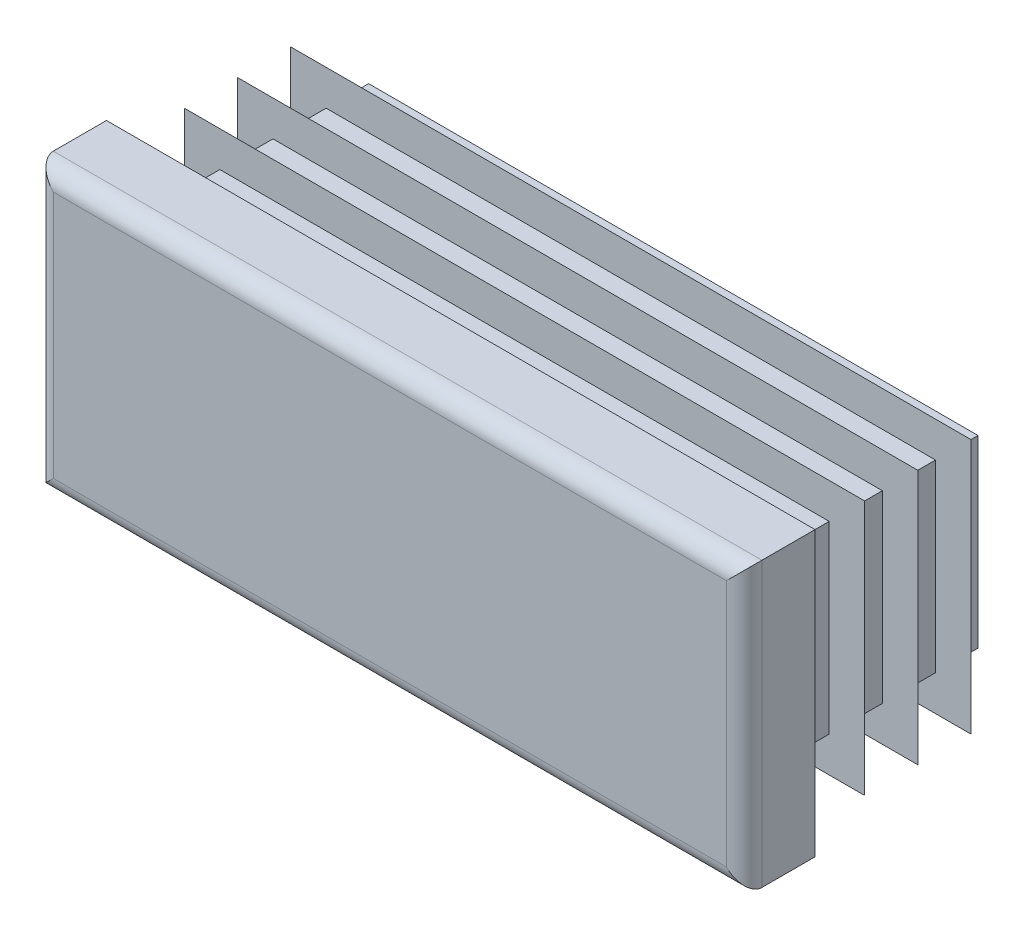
ISO-10303-21;
HEADER;
FILE_DESCRIPTION(('STEP AP214'),'2;1');
FILE_NAME('part.step','',(''),(''),'','','');
FILE_SCHEMA(('AUTOMOTIVE_DESIGN { 1 0 10303 214 1 1 1 1 }'));
ENDSEC;
DATA;
#1=APPLICATION_CONTEXT('core data for automotive mechanical design processes');
#2=APPLICATION_PROTOCOL_DEFINITION('international standard','automotive_design',2000,#1);
#3=PRODUCT_CONTEXT('',#1,'mechanical');
#4=PRODUCT('Part','Part','',(#3));
#5=PRODUCT_RELATED_PRODUCT_CATEGORY('part','',(#4));
#6=PRODUCT_DEFINITION_FORMATION('','',#4);
#7=PRODUCT_DEFINITION_CONTEXT('part definition',#1,'design');
#8=PRODUCT_DEFINITION('design','',#6,#7);
#9=PRODUCT_DEFINITION_SHAPE('','',#8);
#10=(LENGTH_UNIT() NAMED_UNIT(*) SI_UNIT(.MILLI.,.METRE.));
#11=(NAMED_UNIT(*) PLANE_ANGLE_UNIT() SI_UNIT($,.RADIAN.));
#12=(NAMED_UNIT(*) SI_UNIT($,.STERADIAN.) SOLID_ANGLE_UNIT());
#13=UNCERTAINTY_MEASURE_WITH_UNIT(LENGTH_MEASURE(1.E-05),#10,'distance_accuracy_value','');
#14=(GEOMETRIC_REPRESENTATION_CONTEXT(3) GLOBAL_UNCERTAINTY_ASSIGNED_CONTEXT((#13)) GLOBAL_UNIT_ASSIGNED_CONTEXT((#10,
#11,#12)) REPRESENTATION_CONTEXT('',''));
#15=CARTESIAN_POINT('',(0.,0.,0.));
#16=DIRECTION('',(0.,0.,1.));
#17=DIRECTION('',(1.,0.,0.));
#18=AXIS2_PLACEMENT_3D('',#15,#16,#17);
#19=CARTESIAN_POINT('',(23.75,-10.,5.));
#20=DIRECTION('',(0.,0.,-1.));
#21=DIRECTION('',(0.,1.,0.));
#22=AXIS2_PLACEMENT_3D('',#19,#20,#21);
#23=PLANE('',#22);
#24=DIRECTION('',(0.,1.,0.));
#25=VECTOR('',#24,1.);
#26=CARTESIAN_POINT('',(-23.75,-10.,5.));
#27=LINE('',#26,#25);
#28=CARTESIAN_POINT('',(-23.75,-8.75,5.));
#29=VERTEX_POINT('',#28);
#30=CARTESIAN_POINT('',(-23.75,8.75,5.));
#31=VERTEX_POINT('',#30);
#32=EDGE_CURVE('E310',#29,#31,#27,.T.);
#33=ORIENTED_EDGE('',*,*,#32,.F.);
#34=DIRECTION('',(-1.,0.,0.));
#35=VECTOR('',#34,1.);
#36=CARTESIAN_POINT('',(25.,-8.75,5.));
#37=LINE('',#36,#35);
#38=CARTESIAN_POINT('',(23.75,-8.75,5.));
#39=VERTEX_POINT('',#38);
#40=EDGE_CURVE('E482',#39,#29,#37,.T.);
#41=ORIENTED_EDGE('',*,*,#40,.F.);
#42=DIRECTION('',(0.,1.,0.));
#43=VECTOR('',#42,1.);
#44=CARTESIAN_POINT('',(23.75,-10.,5.));
#45=LINE('',#44,#43);
#46=CARTESIAN_POINT('',(23.75,8.75,5.));
#47=VERTEX_POINT('',#46);
#48=EDGE_CURVE('E305',#39,#47,#45,.T.);
#49=ORIENTED_EDGE('',*,*,#48,.T.);
#50=DIRECTION('',(-1.,0.,0.));
#51=VECTOR('',#50,1.);
#52=CARTESIAN_POINT('',(25.,8.75,5.));
#53=LINE('',#52,#51);
#54=EDGE_CURVE('E630',#47,#31,#53,.T.);
#55=ORIENTED_EDGE('',*,*,#54,.T.);
#56=EDGE_LOOP('',(#33,#41,#49,#55));
#57=FACE_BOUND('',#56,.T.);
#58=ADVANCED_FACE('F14',(#57),#23,.F.);
#59=CARTESIAN_POINT('',(-23.75,-10.,3.75));
#60=DIRECTION('',(0.,1.,0.));
#61=DIRECTION('',(-1.,0.,0.));
#62=AXIS2_PLACEMENT_3D('',#59,#60,#61);
#63=CYLINDRICAL_SURFACE('',#62,1.25);
#64=DIRECTION('',(0.,1.,0.));
#65=VECTOR('',#64,1.);
#66=CARTESIAN_POINT('',(-25.,-10.,3.75));
#67=LINE('',#66,#65);
#68=CARTESIAN_POINT('',(-25.,-10.,3.75));
#69=VERTEX_POINT('',#68);
#70=CARTESIAN_POINT('',(-25.,10.,3.75));
#71=VERTEX_POINT('',#70);
#72=EDGE_CURVE('E402',#69,#71,#67,.T.);
#73=ORIENTED_EDGE('',*,*,#72,.F.);
#74=CARTESIAN_POINT('',(-23.75,-8.75,3.75));
#75=DIRECTION('',(-0.707106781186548,0.707106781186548,0.));
#76=DIRECTION('',(0.707106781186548,0.707106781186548,0.));
#77=AXIS2_PLACEMENT_3D('',#74,#75,#76);
#78=ELLIPSE('',#77,1.76776695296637,1.25);
#79=EDGE_CURVE('E59',#69,#29,#78,.T.);
#80=ORIENTED_EDGE('',*,*,#79,.T.);
#81=ORIENTED_EDGE('',*,*,#32,.T.);
#82=CARTESIAN_POINT('',(-23.75,8.75,3.75));
#83=DIRECTION('',(0.707106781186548,0.707106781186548,0.));
#84=DIRECTION('',(-0.707106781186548,0.707106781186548,0.));
#85=AXIS2_PLACEMENT_3D('',#82,#83,#84);
#86=ELLIPSE('',#85,1.76776695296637,1.25);
#87=EDGE_CURVE('E306',#31,#71,#86,.F.);
#88=ORIENTED_EDGE('',*,*,#87,.T.);
#89=EDGE_LOOP('',(#73,#80,#81,#88));
#90=FACE_BOUND('',#89,.T.);
#91=ADVANCED_FACE('F16',(#90),#63,.T.);
#92=CARTESIAN_POINT('',(-25.,-10.,3.75));
#93=DIRECTION('',(1.,0.,0.));
#94=DIRECTION('',(0.,1.,0.));
#95=AXIS2_PLACEMENT_3D('',#92,#93,#94);
#96=PLANE('',#95);
#97=DIRECTION('',(0.,0.,-1.));
#98=VECTOR('',#97,1.);
#99=CARTESIAN_POINT('',(-25.,10.,3.75));
#100=LINE('',#99,#98);
#101=CARTESIAN_POINT('',(-25.,10.,0.));
#102=VERTEX_POINT('',#101);
#103=EDGE_CURVE('E615',#71,#102,#100,.T.);
#104=ORIENTED_EDGE('',*,*,#103,.T.);
#105=DIRECTION('',(0.,1.,0.));
#106=VECTOR('',#105,1.);
#107=CARTESIAN_POINT('',(-25.,-10.,0.));
#108=LINE('',#107,#106);
#109=CARTESIAN_POINT('',(-25.,-10.,0.));
#110=VERTEX_POINT('',#109);
#111=EDGE_CURVE('E400',#110,#102,#108,.T.);
#112=ORIENTED_EDGE('',*,*,#111,.F.);
#113=DIRECTION('',(0.,0.,-1.));
#114=VECTOR('',#113,1.);
#115=CARTESIAN_POINT('',(-25.,-10.,3.75));
#116=LINE('',#115,#114);
#117=EDGE_CURVE('E616',#69,#110,#116,.T.);
#118=ORIENTED_EDGE('',*,*,#117,.F.);
#119=ORIENTED_EDGE('',*,*,#72,.T.);
#120=EDGE_LOOP('',(#104,#112,#118,#119));
#121=FACE_BOUND('',#120,.T.);
#122=ADVANCED_FACE('F697',(#121),#96,.F.);
#123=CARTESIAN_POINT('',(-21.5,-10.,0.));
#124=DIRECTION('',(1.,0.,0.));
#125=DIRECTION('',(0.,1.,0.));
#126=AXIS2_PLACEMENT_3D('',#123,#124,#125);
#127=PLANE('',#126);
#128=DIRECTION('',(0.,1.,0.));
#129=VECTOR('',#128,1.);
#130=CARTESIAN_POINT('',(-21.5,-10.,0.));
#131=LINE('',#130,#129);
#132=CARTESIAN_POINT('',(-21.5,-6.5,0.));
#133=VERTEX_POINT('',#132);
#134=CARTESIAN_POINT('',(-21.5,6.5,0.));
#135=VERTEX_POINT('',#134);
#136=EDGE_CURVE('E397',#133,#135,#131,.T.);
#137=ORIENTED_EDGE('',*,*,#136,.T.);
#138=DIRECTION('',(0.,0.,-1.));
#139=VECTOR('',#138,1.);
#140=CARTESIAN_POINT('',(-21.5,6.5,0.));
#141=LINE('',#140,#139);
#142=CARTESIAN_POINT('',(-21.5,6.5,-0.75));
#143=VERTEX_POINT('',#142);
#144=EDGE_CURVE('E495',#135,#143,#141,.T.);
#145=ORIENTED_EDGE('',*,*,#144,.T.);
#146=DIRECTION('',(0.,1.,0.));
#147=VECTOR('',#146,1.);
#148=CARTESIAN_POINT('',(-21.5,-10.,-0.75));
#149=LINE('',#148,#147);
#150=CARTESIAN_POINT('',(-21.5,-6.5,-0.75));
#151=VERTEX_POINT('',#150);
#152=EDGE_CURVE('E394',#151,#143,#149,.T.);
#153=ORIENTED_EDGE('',*,*,#152,.F.);
#154=DIRECTION('',(0.,0.,1.));
#155=VECTOR('',#154,1.);
#156=CARTESIAN_POINT('',(-21.5,-6.5,0.));
#157=LINE('',#156,#155);
#158=EDGE_CURVE('E489',#151,#133,#157,.T.);
#159=ORIENTED_EDGE('',*,*,#158,.T.);
#160=EDGE_LOOP('',(#137,#145,#153,#159));
#161=FACE_BOUND('',#160,.T.);
#162=ADVANCED_FACE('F787',(#161),#127,.F.);
#163=CARTESIAN_POINT('',(-24.,-10.,-0.75));
#164=DIRECTION('',(0.342020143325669,0.,0.939692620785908));
#165=DIRECTION('',(-0.939692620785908,0.,0.342020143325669));
#166=AXIS2_PLACEMENT_3D('',#163,#164,#165);
#167=PLANE('',#166);
#168=DIRECTION('',(0.,1.,0.));
#169=VECTOR('',#168,1.);
#170=CARTESIAN_POINT('',(-24.,-10.,-0.75));
#171=LINE('',#170,#169);
#172=CARTESIAN_POINT('',(-24.,-9.,-0.75));
#173=VERTEX_POINT('',#172);
#174=CARTESIAN_POINT('',(-24.,9.,-0.75));
#175=VERTEX_POINT('',#174);
#176=EDGE_CURVE('E392',#173,#175,#171,.T.);
#177=ORIENTED_EDGE('',*,*,#176,.T.);
#178=DIRECTION('',(0.844349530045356,-0.438895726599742,-0.307318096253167));
#179=VECTOR('',#178,1.);
#180=CARTESIAN_POINT('',(-16.9589533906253,5.34004028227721,-3.31273138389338));
#181=LINE('',#180,#179);
#182=CARTESIAN_POINT('',(-21.5,7.70049158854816,-1.65992558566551));
#183=VERTEX_POINT('',#182);
#184=EDGE_CURVE('E519',#175,#183,#181,.T.);
#185=ORIENTED_EDGE('',*,*,#184,.T.);
#186=DIRECTION('',(0.,1.,0.));
#187=VECTOR('',#186,1.);
#188=CARTESIAN_POINT('',(-21.5,-10.,-1.65992558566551));
#189=LINE('',#188,#187);
#190=CARTESIAN_POINT('',(-21.5,-7.70049158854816,-1.65992558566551));
#191=VERTEX_POINT('',#190);
#192=EDGE_CURVE('E389',#191,#183,#189,.T.);
#193=ORIENTED_EDGE('',*,*,#192,.F.);
#194=DIRECTION('',(-0.844349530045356,-0.438895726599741,0.307318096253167));
#195=VECTOR('',#194,1.);
#196=CARTESIAN_POINT('',(-24.3705814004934,-9.19262945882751,-0.615119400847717));
#197=LINE('',#196,#195);
#198=EDGE_CURVE('E507',#191,#173,#197,.T.);
#199=ORIENTED_EDGE('',*,*,#198,.T.);
#200=EDGE_LOOP('',(#177,#185,#193,#199));
#201=FACE_BOUND('',#200,.T.);
#202=ADVANCED_FACE('F783',(#201),#167,.F.);
#203=CARTESIAN_POINT('',(-21.5,-10.,-1.65992558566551));
#204=DIRECTION('',(1.,0.,0.));
#205=DIRECTION('',(0.,1.,0.));
#206=AXIS2_PLACEMENT_3D('',#203,#204,#205);
#207=PLANE('',#206);
#208=ORIENTED_EDGE('',*,*,#192,.T.);
#209=DIRECTION('',(0.,-0.819152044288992,-0.573576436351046));
#210=VECTOR('',#209,1.);
#211=CARTESIAN_POINT('',(-21.5,-4.17671654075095,-9.97643625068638));
#212=LINE('',#211,#210);
#213=CARTESIAN_POINT('',(-21.5,6.5,-2.50051884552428));
#214=VERTEX_POINT('',#213);
#215=EDGE_CURVE('E516',#183,#214,#212,.T.);
#216=ORIENTED_EDGE('',*,*,#215,.T.);
#217=DIRECTION('',(0.,0.,-1.));
#218=VECTOR('',#217,1.);
#219=CARTESIAN_POINT('',(-21.5,6.5,-1.65992558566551));
#220=LINE('',#219,#218);
#221=CARTESIAN_POINT('',(-21.5,6.5,-4.5));
#222=VERTEX_POINT('',#221);
#223=EDGE_CURVE('E525',#214,#222,#220,.T.);
#224=ORIENTED_EDGE('',*,*,#223,.T.);
#225=DIRECTION('',(0.,1.,0.));
#226=VECTOR('',#225,1.);
#227=CARTESIAN_POINT('',(-21.5,-10.,-4.5));
#228=LINE('',#227,#226);
#229=CARTESIAN_POINT('',(-21.5,-6.5,-4.5));
#230=VERTEX_POINT('',#229);
#231=EDGE_CURVE('E386',#230,#222,#228,.T.);
#232=ORIENTED_EDGE('',*,*,#231,.F.);
#233=DIRECTION('',(0.,0.,1.));
#234=VECTOR('',#233,1.);
#235=CARTESIAN_POINT('',(-21.5,-6.5,-1.65992558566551));
#236=LINE('',#235,#234);
#237=CARTESIAN_POINT('',(-21.5,-6.5,-2.50051884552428));
#238=VERTEX_POINT('',#237);
#239=EDGE_CURVE('E522',#230,#238,#236,.T.);
#240=ORIENTED_EDGE('',*,*,#239,.T.);
#241=DIRECTION('',(0.,-0.819152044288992,0.573576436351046));
#242=VECTOR('',#241,1.);
#243=CARTESIAN_POINT('',(-21.5,-9.24348489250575,-0.579510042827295));
#244=LINE('',#243,#242);
#245=EDGE_CURVE('E504',#238,#191,#244,.T.);
#246=ORIENTED_EDGE('',*,*,#245,.T.);
#247=EDGE_LOOP('',(#208,#216,#224,#232,#240,#246));
#248=FACE_BOUND('',#247,.T.);
#249=ADVANCED_FACE('F779',(#248),#207,.F.);
#250=CARTESIAN_POINT('',(-24.,-10.,-4.5));
#251=DIRECTION('',(0.342020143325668,0.,0.939692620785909));
#252=DIRECTION('',(-0.939692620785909,0.,0.342020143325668));
#253=AXIS2_PLACEMENT_3D('',#250,#251,#252);
#254=PLANE('',#253);
#255=DIRECTION('',(0.,1.,0.));
#256=VECTOR('',#255,1.);
#257=CARTESIAN_POINT('',(-24.,-10.,-4.5));
#258=LINE('',#257,#256);
#259=CARTESIAN_POINT('',(-24.,-9.,-4.5));
#260=VERTEX_POINT('',#259);
#261=CARTESIAN_POINT('',(-24.,9.,-4.5));
#262=VERTEX_POINT('',#261);
#263=EDGE_CURVE('E384',#260,#262,#258,.T.);
#264=ORIENTED_EDGE('',*,*,#263,.T.);
#265=DIRECTION('',(0.844349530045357,-0.43889572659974,-0.307318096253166));
#266=VECTOR('',#265,1.);
#267=CARTESIAN_POINT('',(-16.9589533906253,5.34004028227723,-7.06273138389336));
#268=LINE('',#267,#266);
#269=CARTESIAN_POINT('',(-21.5,7.70049158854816,-5.4099255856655));
#270=VERTEX_POINT('',#269);
#271=EDGE_CURVE('E549',#262,#270,#268,.T.);
#272=ORIENTED_EDGE('',*,*,#271,.T.);
#273=DIRECTION('',(0.,1.,0.));
#274=VECTOR('',#273,1.);
#275=CARTESIAN_POINT('',(-21.5,-10.,-5.4099255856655));
#276=LINE('',#275,#274);
#277=CARTESIAN_POINT('',(-21.5,-7.70049158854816,-5.4099255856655));
#278=VERTEX_POINT('',#277);
#279=EDGE_CURVE('E381',#278,#270,#276,.T.);
#280=ORIENTED_EDGE('',*,*,#279,.F.);
#281=DIRECTION('',(-0.844349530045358,-0.43889572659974,0.307318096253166));
#282=VECTOR('',#281,1.);
#283=CARTESIAN_POINT('',(-24.3705814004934,-9.19262945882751,-4.36511940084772));
#284=LINE('',#283,#282);
#285=EDGE_CURVE('E537',#278,#260,#284,.T.);
#286=ORIENTED_EDGE('',*,*,#285,.T.);
#287=EDGE_LOOP('',(#264,#272,#280,#286));
#288=FACE_BOUND('',#287,.T.);
#289=ADVANCED_FACE('F775',(#288),#254,.F.);
#290=CARTESIAN_POINT('',(-21.5,-10.,-5.4099255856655));
#291=DIRECTION('',(1.,0.,0.));
#292=DIRECTION('',(0.,1.,0.));
#293=AXIS2_PLACEMENT_3D('',#290,#291,#292);
#294=PLANE('',#293);
#295=ORIENTED_EDGE('',*,*,#279,.T.);
#296=DIRECTION('',(0.,-0.819152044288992,-0.573576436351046));
#297=VECTOR('',#296,1.);
#298=CARTESIAN_POINT('',(-21.5,-4.17671654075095,-13.7264362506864));
#299=LINE('',#298,#297);
#300=CARTESIAN_POINT('',(-21.5,6.5,-6.25051884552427));
#301=VERTEX_POINT('',#300);
#302=EDGE_CURVE('E546',#270,#301,#299,.T.);
#303=ORIENTED_EDGE('',*,*,#302,.T.);
#304=DIRECTION('',(0.,0.,-1.));
#305=VECTOR('',#304,1.);
#306=CARTESIAN_POINT('',(-21.5,6.5,-5.4099255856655));
#307=LINE('',#306,#305);
#308=CARTESIAN_POINT('',(-21.5,6.5,-8.25));
#309=VERTEX_POINT('',#308);
#310=EDGE_CURVE('E555',#301,#309,#307,.T.);
#311=ORIENTED_EDGE('',*,*,#310,.T.);
#312=DIRECTION('',(0.,1.,0.));
#313=VECTOR('',#312,1.);
#314=CARTESIAN_POINT('',(-21.5,-10.,-8.25));
#315=LINE('',#314,#313);
#316=CARTESIAN_POINT('',(-21.5,-6.5,-8.25));
#317=VERTEX_POINT('',#316);
#318=EDGE_CURVE('E378',#317,#309,#315,.T.);
#319=ORIENTED_EDGE('',*,*,#318,.F.);
#320=DIRECTION('',(0.,0.,1.));
#321=VECTOR('',#320,1.);
#322=CARTESIAN_POINT('',(-21.5,-6.5,-5.4099255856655));
#323=LINE('',#322,#321);
#324=CARTESIAN_POINT('',(-21.5,-6.5,-6.25051884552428));
#325=VERTEX_POINT('',#324);
#326=EDGE_CURVE('E552',#317,#325,#323,.T.);
#327=ORIENTED_EDGE('',*,*,#326,.T.);
#328=DIRECTION('',(0.,-0.819152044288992,0.573576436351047));
#329=VECTOR('',#328,1.);
#330=CARTESIAN_POINT('',(-21.5,-9.24348489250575,-4.32951004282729));
#331=LINE('',#330,#329);
#332=EDGE_CURVE('E534',#325,#278,#331,.T.);
#333=ORIENTED_EDGE('',*,*,#332,.T.);
#334=EDGE_LOOP('',(#295,#303,#311,#319,#327,#333));
#335=FACE_BOUND('',#334,.T.);
#336=ADVANCED_FACE('F771',(#335),#294,.F.);
#337=CARTESIAN_POINT('',(-24.,-10.,-8.25));
#338=DIRECTION('',(0.342020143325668,0.,0.939692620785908));
#339=DIRECTION('',(-0.939692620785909,0.,0.342020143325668));
#340=AXIS2_PLACEMENT_3D('',#337,#338,#339);
#341=PLANE('',#340);
#342=DIRECTION('',(0.,1.,0.));
#343=VECTOR('',#342,1.);
#344=CARTESIAN_POINT('',(-24.,-10.,-8.25));
#345=LINE('',#344,#343);
#346=CARTESIAN_POINT('',(-24.,-9.,-8.25));
#347=VERTEX_POINT('',#346);
#348=CARTESIAN_POINT('',(-24.,9.,-8.25));
#349=VERTEX_POINT('',#348);
#350=EDGE_CURVE('E376',#347,#349,#345,.T.);
#351=ORIENTED_EDGE('',*,*,#350,.T.);
#352=DIRECTION('',(0.844349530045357,-0.438895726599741,-0.307318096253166));
#353=VECTOR('',#352,1.);
#354=CARTESIAN_POINT('',(-16.9589533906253,5.34004028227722,-10.8127313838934));
#355=LINE('',#354,#353);
#356=CARTESIAN_POINT('',(-21.5,7.70049158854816,-9.1599255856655));
#357=VERTEX_POINT('',#356);
#358=EDGE_CURVE('E579',#349,#357,#355,.T.);
#359=ORIENTED_EDGE('',*,*,#358,.T.);
#360=DIRECTION('',(0.,1.,0.));
#361=VECTOR('',#360,1.);
#362=CARTESIAN_POINT('',(-21.5,-10.,-9.1599255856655));
#363=LINE('',#362,#361);
#364=CARTESIAN_POINT('',(-21.5,-7.70049158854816,-9.1599255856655));
#365=VERTEX_POINT('',#364);
#366=EDGE_CURVE('E373',#365,#357,#363,.T.);
#367=ORIENTED_EDGE('',*,*,#366,.F.);
#368=DIRECTION('',(-0.844349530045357,-0.43889572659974,0.307318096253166));
#369=VECTOR('',#368,1.);
#370=CARTESIAN_POINT('',(-24.3705814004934,-9.19262945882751,-8.11511940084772));
#371=LINE('',#370,#369);
#372=EDGE_CURVE('E567',#365,#347,#371,.T.);
#373=ORIENTED_EDGE('',*,*,#372,.T.);
#374=EDGE_LOOP('',(#351,#359,#367,#373));
#375=FACE_BOUND('',#374,.T.);
#376=ADVANCED_FACE('F767',(#375),#341,.F.);
#377=CARTESIAN_POINT('',(-21.5,-10.,-9.1599255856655));
#378=DIRECTION('',(1.,0.,0.));
#379=DIRECTION('',(0.,1.,0.));
#380=AXIS2_PLACEMENT_3D('',#377,#378,#379);
#381=PLANE('',#380);
#382=ORIENTED_EDGE('',*,*,#366,.T.);
#383=DIRECTION('',(0.,-0.819152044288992,-0.573576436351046));
#384=VECTOR('',#383,1.);
#385=CARTESIAN_POINT('',(-21.5,-4.17671654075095,-17.4764362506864));
#386=LINE('',#385,#384);
#387=CARTESIAN_POINT('',(-21.5,6.5,-10.0005188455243));
#388=VERTEX_POINT('',#387);
#389=EDGE_CURVE('E576',#357,#388,#386,.T.);
#390=ORIENTED_EDGE('',*,*,#389,.T.);
#391=DIRECTION('',(0.,0.,-1.));
#392=VECTOR('',#391,1.);
#393=CARTESIAN_POINT('',(-21.5,6.5,-9.1599255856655));
#394=LINE('',#393,#392);
#395=CARTESIAN_POINT('',(-21.5,6.5,-12.));
#396=VERTEX_POINT('',#395);
#397=EDGE_CURVE('E585',#388,#396,#394,.T.);
#398=ORIENTED_EDGE('',*,*,#397,.T.);
#399=DIRECTION('',(0.,1.,0.));
#400=VECTOR('',#399,1.);
#401=CARTESIAN_POINT('',(-21.5,-10.,-12.));
#402=LINE('',#401,#400);
#403=CARTESIAN_POINT('',(-21.5,-6.5,-12.));
#404=VERTEX_POINT('',#403);
#405=EDGE_CURVE('E370',#404,#396,#402,.T.);
#406=ORIENTED_EDGE('',*,*,#405,.F.);
#407=DIRECTION('',(0.,0.,1.));
#408=VECTOR('',#407,1.);
#409=CARTESIAN_POINT('',(-21.5,-6.5,-9.1599255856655));
#410=LINE('',#409,#408);
#411=CARTESIAN_POINT('',(-21.5,-6.5,-10.0005188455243));
#412=VERTEX_POINT('',#411);
#413=EDGE_CURVE('E582',#404,#412,#410,.T.);
#414=ORIENTED_EDGE('',*,*,#413,.T.);
#415=DIRECTION('',(0.,-0.819152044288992,0.573576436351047));
#416=VECTOR('',#415,1.);
#417=CARTESIAN_POINT('',(-21.5,-9.24348489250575,-8.0795100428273));
#418=LINE('',#417,#416);
#419=EDGE_CURVE('E564',#412,#365,#418,.T.);
#420=ORIENTED_EDGE('',*,*,#419,.T.);
#421=EDGE_LOOP('',(#382,#390,#398,#406,#414,#420));
#422=FACE_BOUND('',#421,.T.);
#423=ADVANCED_FACE('F764',(#422),#381,.F.);
#424=CARTESIAN_POINT('',(-24.,-10.,-12.));
#425=DIRECTION('',(0.342020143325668,0.,0.939692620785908));
#426=DIRECTION('',(-0.939692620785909,0.,0.342020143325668));
#427=AXIS2_PLACEMENT_3D('',#424,#425,#426);
#428=PLANE('',#427);
#429=DIRECTION('',(0.,1.,0.));
#430=VECTOR('',#429,1.);
#431=CARTESIAN_POINT('',(-24.,-10.,-12.));
#432=LINE('',#431,#430);
#433=CARTESIAN_POINT('',(-24.,-9.,-12.));
#434=VERTEX_POINT('',#433);
#435=CARTESIAN_POINT('',(-24.,9.,-12.));
#436=VERTEX_POINT('',#435);
#437=EDGE_CURVE('E368',#434,#436,#432,.T.);
#438=ORIENTED_EDGE('',*,*,#437,.T.);
#439=DIRECTION('',(0.844349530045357,-0.438895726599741,-0.307318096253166));
#440=VECTOR('',#439,1.);
#441=CARTESIAN_POINT('',(-16.9589533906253,5.34004028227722,-14.5627313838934));
#442=LINE('',#441,#440);
#443=CARTESIAN_POINT('',(-21.5,7.70049158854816,-12.9099255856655));
#444=VERTEX_POINT('',#443);
#445=EDGE_CURVE('E607',#436,#444,#442,.T.);
#446=ORIENTED_EDGE('',*,*,#445,.T.);
#447=DIRECTION('',(0.,1.,0.));
#448=VECTOR('',#447,1.);
#449=CARTESIAN_POINT('',(-21.5,-10.,-12.9099255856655));
#450=LINE('',#449,#448);
#451=CARTESIAN_POINT('',(-21.5,-7.70049158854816,-12.9099255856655));
#452=VERTEX_POINT('',#451);
#453=EDGE_CURVE('E365',#452,#444,#450,.T.);
#454=ORIENTED_EDGE('',*,*,#453,.F.);
#455=DIRECTION('',(-0.844349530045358,-0.43889572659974,0.307318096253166));
#456=VECTOR('',#455,1.);
#457=CARTESIAN_POINT('',(-24.3705814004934,-9.19262945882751,-11.8651194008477));
#458=LINE('',#457,#456);
#459=EDGE_CURVE('E595',#452,#434,#458,.T.);
#460=ORIENTED_EDGE('',*,*,#459,.T.);
#461=EDGE_LOOP('',(#438,#446,#454,#460));
#462=FACE_BOUND('',#461,.T.);
#463=ADVANCED_FACE('F675',(#462),#428,.F.);
#464=CARTESIAN_POINT('',(-21.5,-10.,-12.9099255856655));
#465=DIRECTION('',(1.,0.,0.));
#466=DIRECTION('',(0.,1.,0.));
#467=AXIS2_PLACEMENT_3D('',#464,#465,#466);
#468=PLANE('',#467);
#469=ORIENTED_EDGE('',*,*,#453,.T.);
#470=DIRECTION('',(0.,-0.819152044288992,-0.573576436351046));
#471=VECTOR('',#470,1.);
#472=CARTESIAN_POINT('',(-21.5,-4.17671654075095,-21.2264362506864));
#473=LINE('',#472,#471);
#474=CARTESIAN_POINT('',(-21.5,6.5,-13.7505188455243));
#475=VERTEX_POINT('',#474);
#476=EDGE_CURVE('E604',#444,#475,#473,.T.);
#477=ORIENTED_EDGE('',*,*,#476,.T.);
#478=DIRECTION('',(0.,0.,-1.));
#479=VECTOR('',#478,1.);
#480=CARTESIAN_POINT('',(-21.5,6.5,-12.9099255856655));
#481=LINE('',#480,#479);
#482=CARTESIAN_POINT('',(-21.5,6.5,-15.));
#483=VERTEX_POINT('',#482);
#484=EDGE_CURVE('E613',#475,#483,#481,.T.);
#485=ORIENTED_EDGE('',*,*,#484,.T.);
#486=DIRECTION('',(0.,1.,0.));
#487=VECTOR('',#486,1.);
#488=CARTESIAN_POINT('',(-21.5,-10.,-15.));
#489=LINE('',#488,#487);
#490=CARTESIAN_POINT('',(-21.5,-6.5,-15.));
#491=VERTEX_POINT('',#490);
#492=EDGE_CURVE('E362',#491,#483,#489,.T.);
#493=ORIENTED_EDGE('',*,*,#492,.F.);
#494=DIRECTION('',(0.,0.,1.));
#495=VECTOR('',#494,1.);
#496=CARTESIAN_POINT('',(-21.5,-6.5,-12.9099255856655));
#497=LINE('',#496,#495);
#498=CARTESIAN_POINT('',(-21.5,-6.5,-13.7505188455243));
#499=VERTEX_POINT('',#498);
#500=EDGE_CURVE('E610',#491,#499,#497,.T.);
#501=ORIENTED_EDGE('',*,*,#500,.T.);
#502=DIRECTION('',(0.,-0.819152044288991,0.573576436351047));
#503=VECTOR('',#502,1.);
#504=CARTESIAN_POINT('',(-21.5,-9.24348489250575,-11.8295100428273));
#505=LINE('',#504,#503);
#506=EDGE_CURVE('E592',#499,#452,#505,.T.);
#507=ORIENTED_EDGE('',*,*,#506,.T.);
#508=EDGE_LOOP('',(#469,#477,#485,#493,#501,#507));
#509=FACE_BOUND('',#508,.T.);
#510=ADVANCED_FACE('F677',(#509),#468,.F.);
#511=CARTESIAN_POINT('',(-21.5,-10.,-15.));
#512=DIRECTION('',(0.,0.,1.));
#513=DIRECTION('',(0.,-1.,0.));
#514=AXIS2_PLACEMENT_3D('',#511,#512,#513);
#515=PLANE('',#514);
#516=ORIENTED_EDGE('',*,*,#492,.T.);
#517=DIRECTION('',(-1.,0.,0.));
#518=VECTOR('',#517,1.);
#519=CARTESIAN_POINT('',(25.,6.5,-15.));
#520=LINE('',#519,#518);
#521=CARTESIAN_POINT('',(21.5,6.5,-15.));
#522=VERTEX_POINT('',#521);
#523=EDGE_CURVE('E438',#522,#483,#520,.T.);
#524=ORIENTED_EDGE('',*,*,#523,.F.);
#525=DIRECTION('',(0.,1.,0.));
#526=VECTOR('',#525,1.);
#527=CARTESIAN_POINT('',(21.5,-10.,-15.));
#528=LINE('',#527,#526);
#529=CARTESIAN_POINT('',(21.5,-6.5,-15.));
#530=VERTEX_POINT('',#529);
#531=EDGE_CURVE('E359',#530,#522,#528,.T.);
#532=ORIENTED_EDGE('',*,*,#531,.F.);
#533=DIRECTION('',(-1.,0.,0.));
#534=VECTOR('',#533,1.);
#535=CARTESIAN_POINT('',(25.,-6.5,-15.));
#536=LINE('',#535,#534);
#537=EDGE_CURVE('E436',#530,#491,#536,.T.);
#538=ORIENTED_EDGE('',*,*,#537,.T.);
#539=EDGE_LOOP('',(#516,#524,#532,#538));
#540=FACE_BOUND('',#539,.T.);
#541=ADVANCED_FACE('F435',(#540),#515,.F.);
#542=CARTESIAN_POINT('',(21.5,-10.,-15.));
#543=DIRECTION('',(-1.,0.,0.));
#544=DIRECTION('',(0.,-1.,0.));
#545=AXIS2_PLACEMENT_3D('',#542,#543,#544);
#546=PLANE('',#545);
#547=DIRECTION('',(0.,0.,1.));
#548=VECTOR('',#547,1.);
#549=CARTESIAN_POINT('',(21.5,6.5,-15.));
#550=LINE('',#549,#548);
#551=CARTESIAN_POINT('',(21.5,6.5,-13.7505188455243));
#552=VERTEX_POINT('',#551);
#553=EDGE_CURVE('E9',#522,#552,#550,.T.);
#554=ORIENTED_EDGE('',*,*,#553,.T.);
#555=DIRECTION('',(0.,0.819152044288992,0.573576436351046));
#556=VECTOR('',#555,1.);
#557=CARTESIAN_POINT('',(21.5,-5.15873029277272,-21.9140496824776));
#558=LINE('',#557,#556);
#559=CARTESIAN_POINT('',(21.5,7.70049158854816,-12.9099255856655));
#560=VERTEX_POINT('',#559);
#561=EDGE_CURVE('E601',#552,#560,#558,.T.);
#562=ORIENTED_EDGE('',*,*,#561,.T.);
#563=DIRECTION('',(0.,1.,0.));
#564=VECTOR('',#563,1.);
#565=CARTESIAN_POINT('',(21.5,-10.,-12.9099255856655));
#566=LINE('',#565,#564);
#567=CARTESIAN_POINT('',(21.5,-7.70049158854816,-12.9099255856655));
#568=VERTEX_POINT('',#567);
#569=EDGE_CURVE('E356',#568,#560,#566,.T.);
#570=ORIENTED_EDGE('',*,*,#569,.F.);
#571=DIRECTION('',(0.,0.819152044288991,-0.573576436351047));
#572=VECTOR('',#571,1.);
#573=CARTESIAN_POINT('',(21.5,-8.26147114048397,-12.5171234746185));
#574=LINE('',#573,#572);
#575=CARTESIAN_POINT('',(21.5,-6.5,-13.7505188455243));
#576=VERTEX_POINT('',#575);
#577=EDGE_CURVE('E428',#568,#576,#574,.T.);
#578=ORIENTED_EDGE('',*,*,#577,.T.);
#579=DIRECTION('',(0.,0.,-1.));
#580=VECTOR('',#579,1.);
#581=CARTESIAN_POINT('',(21.5,-6.5,-15.));
#582=LINE('',#581,#580);
#583=EDGE_CURVE('E23',#576,#530,#582,.T.);
#584=ORIENTED_EDGE('',*,*,#583,.T.);
#585=ORIENTED_EDGE('',*,*,#531,.T.);
#586=EDGE_LOOP('',(#554,#562,#570,#578,#584,#585));
#587=FACE_BOUND('',#586,.T.);
#588=ADVANCED_FACE('F426',(#587),#546,.F.);
#589=CARTESIAN_POINT('',(21.5,-10.,-12.9099255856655));
#590=DIRECTION('',(-0.342020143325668,0.,0.939692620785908));
#591=DIRECTION('',(-0.939692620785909,0.,-0.342020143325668));
#592=AXIS2_PLACEMENT_3D('',#589,#590,#591);
#593=PLANE('',#592);
#594=ORIENTED_EDGE('',*,*,#569,.T.);
#595=DIRECTION('',(0.844349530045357,0.438895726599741,0.307318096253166));
#596=VECTOR('',#595,1.);
#597=CARTESIAN_POINT('',(14.9405270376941,4.29085547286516,-15.2973784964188));
#598=LINE('',#597,#596);
#599=CARTESIAN_POINT('',(24.,9.,-12.));
#600=VERTEX_POINT('',#599);
#601=EDGE_CURVE('E598',#560,#600,#598,.T.);
#602=ORIENTED_EDGE('',*,*,#601,.T.);
#603=DIRECTION('',(0.,1.,0.));
#604=VECTOR('',#603,1.);
#605=CARTESIAN_POINT('',(24.,-10.,-12.));
#606=LINE('',#605,#604);
#607=CARTESIAN_POINT('',(24.,-9.,-12.));
#608=VERTEX_POINT('',#607);
#609=EDGE_CURVE('E353',#608,#600,#606,.T.);
#610=ORIENTED_EDGE('',*,*,#609,.F.);
#611=DIRECTION('',(-0.844349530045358,0.43889572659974,-0.307318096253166));
#612=VECTOR('',#611,1.);
#613=CARTESIAN_POINT('',(22.3521550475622,-8.14344464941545,-12.5997665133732));
#614=LINE('',#613,#612);
#615=EDGE_CURVE('E588',#608,#568,#614,.T.);
#616=ORIENTED_EDGE('',*,*,#615,.T.);
#617=EDGE_LOOP('',(#594,#602,#610,#616));
#618=FACE_BOUND('',#617,.T.);
#619=ADVANCED_FACE('F752',(#618),#593,.F.);
#620=CARTESIAN_POINT('',(24.,-10.,-12.));
#621=DIRECTION('',(0.,0.,-1.));
#622=DIRECTION('',(0.,1.,0.));
#623=AXIS2_PLACEMENT_3D('',#620,#621,#622);
#624=PLANE('',#623);
#625=ORIENTED_EDGE('',*,*,#609,.T.);
#626=DIRECTION('',(-1.,0.,0.));
#627=VECTOR('',#626,1.);
#628=CARTESIAN_POINT('',(25.,9.,-12.));
#629=LINE('',#628,#627);
#630=EDGE_CURVE('E444',#600,#436,#629,.T.);
#631=ORIENTED_EDGE('',*,*,#630,.T.);
#632=ORIENTED_EDGE('',*,*,#437,.F.);
#633=DIRECTION('',(-1.,0.,0.));
#634=VECTOR('',#633,1.);
#635=CARTESIAN_POINT('',(25.,-9.,-12.));
#636=LINE('',#635,#634);
#637=EDGE_CURVE('E451',#608,#434,#636,.T.);
#638=ORIENTED_EDGE('',*,*,#637,.F.);
#639=EDGE_LOOP('',(#625,#631,#632,#638));
#640=FACE_BOUND('',#639,.T.);
#641=ORIENTED_EDGE('',*,*,#405,.T.);
#642=DIRECTION('',(-1.,0.,0.));
#643=VECTOR('',#642,1.);
#644=CARTESIAN_POINT('',(25.,6.5,-12.));
#645=LINE('',#644,#643);
#646=CARTESIAN_POINT('',(21.5,6.5,-12.));
#647=VERTEX_POINT('',#646);
#648=EDGE_CURVE('E663',#647,#396,#645,.T.);
#649=ORIENTED_EDGE('',*,*,#648,.F.);
#650=DIRECTION('',(0.,1.,0.));
#651=VECTOR('',#650,1.);
#652=CARTESIAN_POINT('',(21.5,-10.,-12.));
#653=LINE('',#652,#651);
#654=CARTESIAN_POINT('',(21.5,-6.5,-12.));
#655=VERTEX_POINT('',#654);
#656=EDGE_CURVE('E350',#655,#647,#653,.T.);
#657=ORIENTED_EDGE('',*,*,#656,.F.);
#658=DIRECTION('',(-1.,0.,0.));
#659=VECTOR('',#658,1.);
#660=CARTESIAN_POINT('',(25.,-6.5,-12.));
#661=LINE('',#660,#659);
#662=EDGE_CURVE('E453',#655,#404,#661,.T.);
#663=ORIENTED_EDGE('',*,*,#662,.T.);
#664=EDGE_LOOP('',(#641,#649,#657,#663));
#665=FACE_BOUND('',#664,.T.);
#666=ADVANCED_FACE('F667',(#640,#665),#624,.F.);
#667=CARTESIAN_POINT('',(21.5,-10.,-12.));
#668=DIRECTION('',(-1.,0.,0.));
#669=DIRECTION('',(0.,-1.,0.));
#670=AXIS2_PLACEMENT_3D('',#667,#668,#669);
#671=PLANE('',#670);
#672=DIRECTION('',(0.,0.,1.));
#673=VECTOR('',#672,1.);
#674=CARTESIAN_POINT('',(21.5,6.5,-12.));
#675=LINE('',#674,#673);
#676=CARTESIAN_POINT('',(21.5,6.5,-10.0005188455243));
#677=VERTEX_POINT('',#676);
#678=EDGE_CURVE('E420',#647,#677,#675,.T.);
#679=ORIENTED_EDGE('',*,*,#678,.T.);
#680=DIRECTION('',(0.,0.819152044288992,0.573576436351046));
#681=VECTOR('',#680,1.);
#682=CARTESIAN_POINT('',(21.5,-5.51111502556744,-18.4107921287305));
#683=LINE('',#682,#681);
#684=CARTESIAN_POINT('',(21.5,7.70049158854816,-9.1599255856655));
#685=VERTEX_POINT('',#684);
#686=EDGE_CURVE('E573',#677,#685,#683,.T.);
#687=ORIENTED_EDGE('',*,*,#686,.T.);
#688=DIRECTION('',(0.,1.,0.));
#689=VECTOR('',#688,1.);
#690=CARTESIAN_POINT('',(21.5,-10.,-9.1599255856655));
#691=LINE('',#690,#689);
#692=CARTESIAN_POINT('',(21.5,-7.70049158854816,-9.1599255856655));
#693=VERTEX_POINT('',#692);
#694=EDGE_CURVE('E347',#693,#685,#691,.T.);
#695=ORIENTED_EDGE('',*,*,#694,.F.);
#696=DIRECTION('',(0.,0.819152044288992,-0.573576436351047));
#697=VECTOR('',#696,1.);
#698=CARTESIAN_POINT('',(21.5,-7.90908640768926,-9.01386592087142));
#699=LINE('',#698,#697);
#700=CARTESIAN_POINT('',(21.5,-6.5,-10.0005188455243));
#701=VERTEX_POINT('',#700);
#702=EDGE_CURVE('E561',#693,#701,#699,.T.);
#703=ORIENTED_EDGE('',*,*,#702,.T.);
#704=DIRECTION('',(0.,0.,-1.));
#705=VECTOR('',#704,1.);
#706=CARTESIAN_POINT('',(21.5,-6.5,-12.));
#707=LINE('',#706,#705);
#708=EDGE_CURVE('E417',#701,#655,#707,.T.);
#709=ORIENTED_EDGE('',*,*,#708,.T.);
#710=ORIENTED_EDGE('',*,*,#656,.T.);
#711=EDGE_LOOP('',(#679,#687,#695,#703,#709,#710));
#712=FACE_BOUND('',#711,.T.);
#713=ADVANCED_FACE('F745',(#712),#671,.F.);
#714=CARTESIAN_POINT('',(21.5,-10.,-9.1599255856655));
#715=DIRECTION('',(-0.342020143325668,0.,0.939692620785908));
#716=DIRECTION('',(-0.939692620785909,0.,-0.342020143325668));
#717=AXIS2_PLACEMENT_3D('',#714,#715,#716);
#718=PLANE('',#717);
#719=ORIENTED_EDGE('',*,*,#694,.T.);
#720=DIRECTION('',(0.844349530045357,0.438895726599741,0.307318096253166));
#721=VECTOR('',#720,1.);
#722=CARTESIAN_POINT('',(14.9405270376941,4.29085547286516,-11.5473784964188));
#723=LINE('',#722,#721);
#724=CARTESIAN_POINT('',(24.,9.,-8.25));
#725=VERTEX_POINT('',#724);
#726=EDGE_CURVE('E570',#685,#725,#723,.T.);
#727=ORIENTED_EDGE('',*,*,#726,.T.);
#728=DIRECTION('',(0.,1.,0.));
#729=VECTOR('',#728,1.);
#730=CARTESIAN_POINT('',(24.,-10.,-8.25));
#731=LINE('',#730,#729);
#732=CARTESIAN_POINT('',(24.,-9.,-8.25));
#733=VERTEX_POINT('',#732);
#734=EDGE_CURVE('E344',#733,#725,#731,.T.);
#735=ORIENTED_EDGE('',*,*,#734,.F.);
#736=DIRECTION('',(-0.844349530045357,0.43889572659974,-0.307318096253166));
#737=VECTOR('',#736,1.);
#738=CARTESIAN_POINT('',(22.3521550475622,-8.14344464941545,-8.84976651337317));
#739=LINE('',#738,#737);
#740=EDGE_CURVE('E558',#733,#693,#739,.T.);
#741=ORIENTED_EDGE('',*,*,#740,.T.);
#742=EDGE_LOOP('',(#719,#727,#735,#741));
#743=FACE_BOUND('',#742,.T.);
#744=ADVANCED_FACE('F741',(#743),#718,.F.);
#745=CARTESIAN_POINT('',(24.,-10.,-8.25));
#746=DIRECTION('',(0.,0.,-1.));
#747=DIRECTION('',(0.,1.,0.));
#748=AXIS2_PLACEMENT_3D('',#745,#746,#747);
#749=PLANE('',#748);
#750=ORIENTED_EDGE('',*,*,#734,.T.);
#751=DIRECTION('',(-1.,0.,0.));
#752=VECTOR('',#751,1.);
#753=CARTESIAN_POINT('',(25.,9.,-8.25));
#754=LINE('',#753,#752);
#755=EDGE_CURVE('E657',#725,#349,#754,.T.);
#756=ORIENTED_EDGE('',*,*,#755,.T.);
#757=ORIENTED_EDGE('',*,*,#350,.F.);
#758=DIRECTION('',(-1.,0.,0.));
#759=VECTOR('',#758,1.);
#760=CARTESIAN_POINT('',(25.,-9.,-8.25));
#761=LINE('',#760,#759);
#762=EDGE_CURVE('E459',#733,#347,#761,.T.);
#763=ORIENTED_EDGE('',*,*,#762,.F.);
#764=EDGE_LOOP('',(#750,#756,#757,#763));
#765=FACE_BOUND('',#764,.T.);
#766=ORIENTED_EDGE('',*,*,#318,.T.);
#767=DIRECTION('',(-1.,0.,0.));
#768=VECTOR('',#767,1.);
#769=CARTESIAN_POINT('',(25.,6.5,-8.25));
#770=LINE('',#769,#768);
#771=CARTESIAN_POINT('',(21.5,6.5,-8.25));
#772=VERTEX_POINT('',#771);
#773=EDGE_CURVE('E655',#772,#309,#770,.T.);
#774=ORIENTED_EDGE('',*,*,#773,.F.);
#775=DIRECTION('',(0.,1.,0.));
#776=VECTOR('',#775,1.);
#777=CARTESIAN_POINT('',(21.5,-10.,-8.25));
#778=LINE('',#777,#776);
#779=CARTESIAN_POINT('',(21.5,-6.5,-8.25));
#780=VERTEX_POINT('',#779);
#781=EDGE_CURVE('E341',#780,#772,#778,.T.);
#782=ORIENTED_EDGE('',*,*,#781,.F.);
#783=DIRECTION('',(-1.,0.,0.));
#784=VECTOR('',#783,1.);
#785=CARTESIAN_POINT('',(25.,-6.5,-8.25));
#786=LINE('',#785,#784);
#787=EDGE_CURVE('E461',#780,#317,#786,.T.);
#788=ORIENTED_EDGE('',*,*,#787,.T.);
#789=EDGE_LOOP('',(#766,#774,#782,#788));
#790=FACE_BOUND('',#789,.T.);
#791=ADVANCED_FACE('F737',(#765,#790),#749,.F.);
#792=CARTESIAN_POINT('',(21.5,-10.,-8.25));
#793=DIRECTION('',(-1.,0.,0.));
#794=DIRECTION('',(0.,-1.,0.));
#795=AXIS2_PLACEMENT_3D('',#792,#793,#794);
#796=PLANE('',#795);
#797=DIRECTION('',(0.,0.,1.));
#798=VECTOR('',#797,1.);
#799=CARTESIAN_POINT('',(21.5,6.5,-8.25));
#800=LINE('',#799,#798);
#801=CARTESIAN_POINT('',(21.5,6.5,-6.25051884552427));
#802=VERTEX_POINT('',#801);
#803=EDGE_CURVE('E414',#772,#802,#800,.T.);
#804=ORIENTED_EDGE('',*,*,#803,.T.);
#805=DIRECTION('',(0.,0.819152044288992,0.573576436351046));
#806=VECTOR('',#805,1.);
#807=CARTESIAN_POINT('',(21.5,-5.51111502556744,-14.6607921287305));
#808=LINE('',#807,#806);
#809=CARTESIAN_POINT('',(21.5,7.70049158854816,-5.40992558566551));
#810=VERTEX_POINT('',#809);
#811=EDGE_CURVE('E543',#802,#810,#808,.T.);
#812=ORIENTED_EDGE('',*,*,#811,.T.);
#813=DIRECTION('',(0.,1.,0.));
#814=VECTOR('',#813,1.);
#815=CARTESIAN_POINT('',(21.5,-10.,-5.40992558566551));
#816=LINE('',#815,#814);
#817=CARTESIAN_POINT('',(21.5,-7.70049158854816,-5.40992558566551));
#818=VERTEX_POINT('',#817);
#819=EDGE_CURVE('E338',#818,#810,#816,.T.);
#820=ORIENTED_EDGE('',*,*,#819,.F.);
#821=DIRECTION('',(0.,0.819152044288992,-0.573576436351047));
#822=VECTOR('',#821,1.);
#823=CARTESIAN_POINT('',(21.5,-7.90908640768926,-5.26386592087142));
#824=LINE('',#823,#822);
#825=CARTESIAN_POINT('',(21.5,-6.5,-6.25051884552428));
#826=VERTEX_POINT('',#825);
#827=EDGE_CURVE('E531',#818,#826,#824,.T.);
#828=ORIENTED_EDGE('',*,*,#827,.T.);
#829=DIRECTION('',(0.,0.,-1.));
#830=VECTOR('',#829,1.);
#831=CARTESIAN_POINT('',(21.5,-6.5,-8.25));
#832=LINE('',#831,#830);
#833=EDGE_CURVE('E411',#826,#780,#832,.T.);
#834=ORIENTED_EDGE('',*,*,#833,.T.);
#835=ORIENTED_EDGE('',*,*,#781,.T.);
#836=EDGE_LOOP('',(#804,#812,#820,#828,#834,#835));
#837=FACE_BOUND('',#836,.T.);
#838=ADVANCED_FACE('F733',(#837),#796,.F.);
#839=CARTESIAN_POINT('',(21.5,-10.,-5.40992558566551));
#840=DIRECTION('',(-0.342020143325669,0.,0.939692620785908));
#841=DIRECTION('',(-0.939692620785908,0.,-0.342020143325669));
#842=AXIS2_PLACEMENT_3D('',#839,#840,#841);
#843=PLANE('',#842);
#844=ORIENTED_EDGE('',*,*,#819,.T.);
#845=DIRECTION('',(0.844349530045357,0.438895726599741,0.307318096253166));
#846=VECTOR('',#845,1.);
#847=CARTESIAN_POINT('',(14.9405270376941,4.29085547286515,-7.79737849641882));
#848=LINE('',#847,#846);
#849=CARTESIAN_POINT('',(24.,9.,-4.5));
#850=VERTEX_POINT('',#849);
#851=EDGE_CURVE('E540',#810,#850,#848,.T.);
#852=ORIENTED_EDGE('',*,*,#851,.T.);
#853=DIRECTION('',(0.,1.,0.));
#854=VECTOR('',#853,1.);
#855=CARTESIAN_POINT('',(24.,-10.,-4.5));
#856=LINE('',#855,#854);
#857=CARTESIAN_POINT('',(24.,-9.,-4.5));
#858=VERTEX_POINT('',#857);
#859=EDGE_CURVE('E335',#858,#850,#856,.T.);
#860=ORIENTED_EDGE('',*,*,#859,.F.);
#861=DIRECTION('',(-0.844349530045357,0.43889572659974,-0.307318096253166));
#862=VECTOR('',#861,1.);
#863=CARTESIAN_POINT('',(22.3521550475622,-8.14344464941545,-5.09976651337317));
#864=LINE('',#863,#862);
#865=EDGE_CURVE('E528',#858,#818,#864,.T.);
#866=ORIENTED_EDGE('',*,*,#865,.T.);
#867=EDGE_LOOP('',(#844,#852,#860,#866));
#868=FACE_BOUND('',#867,.T.);
#869=ADVANCED_FACE('F729',(#868),#843,.F.);
#870=CARTESIAN_POINT('',(24.,-10.,-4.5));
#871=DIRECTION('',(0.,0.,-1.));
#872=DIRECTION('',(0.,1.,0.));
#873=AXIS2_PLACEMENT_3D('',#870,#871,#872);
#874=PLANE('',#873);
#875=ORIENTED_EDGE('',*,*,#859,.T.);
#876=DIRECTION('',(-1.,0.,0.));
#877=VECTOR('',#876,1.);
#878=CARTESIAN_POINT('',(25.,9.,-4.5));
#879=LINE('',#878,#877);
#880=EDGE_CURVE('E649',#850,#262,#879,.T.);
#881=ORIENTED_EDGE('',*,*,#880,.T.);
#882=ORIENTED_EDGE('',*,*,#263,.F.);
#883=DIRECTION('',(-1.,0.,0.));
#884=VECTOR('',#883,1.);
#885=CARTESIAN_POINT('',(25.,-9.,-4.5));
#886=LINE('',#885,#884);
#887=EDGE_CURVE('E467',#858,#260,#886,.T.);
#888=ORIENTED_EDGE('',*,*,#887,.F.);
#889=EDGE_LOOP('',(#875,#881,#882,#888));
#890=FACE_BOUND('',#889,.T.);
#891=ORIENTED_EDGE('',*,*,#231,.T.);
#892=DIRECTION('',(-1.,0.,0.));
#893=VECTOR('',#892,1.);
#894=CARTESIAN_POINT('',(25.,6.5,-4.5));
#895=LINE('',#894,#893);
#896=CARTESIAN_POINT('',(21.5,6.5,-4.5));
#897=VERTEX_POINT('',#896);
#898=EDGE_CURVE('E647',#897,#222,#895,.T.);
#899=ORIENTED_EDGE('',*,*,#898,.F.);
#900=DIRECTION('',(0.,1.,0.));
#901=VECTOR('',#900,1.);
#902=CARTESIAN_POINT('',(21.5,-10.,-4.5));
#903=LINE('',#902,#901);
#904=CARTESIAN_POINT('',(21.5,-6.5,-4.5));
#905=VERTEX_POINT('',#904);
#906=EDGE_CURVE('E332',#905,#897,#903,.T.);
#907=ORIENTED_EDGE('',*,*,#906,.F.);
#908=DIRECTION('',(-1.,0.,0.));
#909=VECTOR('',#908,1.);
#910=CARTESIAN_POINT('',(25.,-6.5,-4.5));
#911=LINE('',#910,#909);
#912=EDGE_CURVE('E469',#905,#230,#911,.T.);
#913=ORIENTED_EDGE('',*,*,#912,.T.);
#914=EDGE_LOOP('',(#891,#899,#907,#913));
#915=FACE_BOUND('',#914,.T.);
#916=ADVANCED_FACE('F725',(#890,#915),#874,.F.);
#917=CARTESIAN_POINT('',(21.5,-10.,-4.5));
#918=DIRECTION('',(-1.,0.,0.));
#919=DIRECTION('',(0.,-1.,0.));
#920=AXIS2_PLACEMENT_3D('',#917,#918,#919);
#921=PLANE('',#920);
#922=DIRECTION('',(0.,0.,1.));
#923=VECTOR('',#922,1.);
#924=CARTESIAN_POINT('',(21.5,6.5,-4.5));
#925=LINE('',#924,#923);
#926=CARTESIAN_POINT('',(21.5,6.5,-2.50051884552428));
#927=VERTEX_POINT('',#926);
#928=EDGE_CURVE('E408',#897,#927,#925,.T.);
#929=ORIENTED_EDGE('',*,*,#928,.T.);
#930=DIRECTION('',(0.,0.819152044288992,0.573576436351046));
#931=VECTOR('',#930,1.);
#932=CARTESIAN_POINT('',(21.5,-5.51111502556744,-10.9107921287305));
#933=LINE('',#932,#931);
#934=CARTESIAN_POINT('',(21.5,7.70049158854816,-1.65992558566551));
#935=VERTEX_POINT('',#934);
#936=EDGE_CURVE('E513',#927,#935,#933,.T.);
#937=ORIENTED_EDGE('',*,*,#936,.T.);
#938=DIRECTION('',(0.,1.,0.));
#939=VECTOR('',#938,1.);
#940=CARTESIAN_POINT('',(21.5,-10.,-1.65992558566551));
#941=LINE('',#940,#939);
#942=CARTESIAN_POINT('',(21.5,-7.70049158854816,-1.65992558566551));
#943=VERTEX_POINT('',#942);
#944=EDGE_CURVE('E329',#943,#935,#941,.T.);
#945=ORIENTED_EDGE('',*,*,#944,.F.);
#946=DIRECTION('',(0.,0.819152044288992,-0.573576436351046));
#947=VECTOR('',#946,1.);
#948=CARTESIAN_POINT('',(21.5,-7.90908640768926,-1.51386592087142));
#949=LINE('',#948,#947);
#950=CARTESIAN_POINT('',(21.5,-6.5,-2.50051884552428));
#951=VERTEX_POINT('',#950);
#952=EDGE_CURVE('E501',#943,#951,#949,.T.);
#953=ORIENTED_EDGE('',*,*,#952,.T.);
#954=DIRECTION('',(0.,0.,-1.));
#955=VECTOR('',#954,1.);
#956=CARTESIAN_POINT('',(21.5,-6.5,-4.5));
#957=LINE('',#956,#955);
#958=EDGE_CURVE('E405',#951,#905,#957,.T.);
#959=ORIENTED_EDGE('',*,*,#958,.T.);
#960=ORIENTED_EDGE('',*,*,#906,.T.);
#961=EDGE_LOOP('',(#929,#937,#945,#953,#959,#960));
#962=FACE_BOUND('',#961,.T.);
#963=ADVANCED_FACE('F721',(#962),#921,.F.);
#964=CARTESIAN_POINT('',(21.5,-10.,-1.65992558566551));
#965=DIRECTION('',(-0.342020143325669,0.,0.939692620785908));
#966=DIRECTION('',(-0.939692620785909,0.,-0.342020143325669));
#967=AXIS2_PLACEMENT_3D('',#964,#965,#966);
#968=PLANE('',#967);
#969=ORIENTED_EDGE('',*,*,#944,.T.);
#970=DIRECTION('',(0.844349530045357,0.438895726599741,0.307318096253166));
#971=VECTOR('',#970,1.);
#972=CARTESIAN_POINT('',(14.9405270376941,4.29085547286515,-4.04737849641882));
#973=LINE('',#972,#971);
#974=CARTESIAN_POINT('',(24.,9.,-0.75));
#975=VERTEX_POINT('',#974);
#976=EDGE_CURVE('E510',#935,#975,#973,.T.);
#977=ORIENTED_EDGE('',*,*,#976,.T.);
#978=DIRECTION('',(0.,1.,0.));
#979=VECTOR('',#978,1.);
#980=CARTESIAN_POINT('',(24.,-10.,-0.75));
#981=LINE('',#980,#979);
#982=CARTESIAN_POINT('',(24.,-9.,-0.75));
#983=VERTEX_POINT('',#982);
#984=EDGE_CURVE('E326',#983,#975,#981,.T.);
#985=ORIENTED_EDGE('',*,*,#984,.F.);
#986=DIRECTION('',(-0.844349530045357,0.438895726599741,-0.307318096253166));
#987=VECTOR('',#986,1.);
#988=CARTESIAN_POINT('',(22.3521550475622,-8.14344464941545,-1.34976651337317));
#989=LINE('',#988,#987);
#990=EDGE_CURVE('E498',#983,#943,#989,.T.);
#991=ORIENTED_EDGE('',*,*,#990,.T.);
#992=EDGE_LOOP('',(#969,#977,#985,#991));
#993=FACE_BOUND('',#992,.T.);
#994=ADVANCED_FACE('F717',(#993),#968,.F.);
#995=CARTESIAN_POINT('',(24.,-10.,-0.75));
#996=DIRECTION('',(0.,0.,-1.));
#997=DIRECTION('',(0.,1.,0.));
#998=AXIS2_PLACEMENT_3D('',#995,#996,#997);
#999=PLANE('',#998);
#1000=ORIENTED_EDGE('',*,*,#984,.T.);
#1001=DIRECTION('',(-1.,0.,0.));
#1002=VECTOR('',#1001,1.);
#1003=CARTESIAN_POINT('',(25.,9.,-0.75));
#1004=LINE('',#1003,#1002);
#1005=EDGE_CURVE('E641',#975,#175,#1004,.T.);
#1006=ORIENTED_EDGE('',*,*,#1005,.T.);
#1007=ORIENTED_EDGE('',*,*,#176,.F.);
#1008=DIRECTION('',(-1.,0.,0.));
#1009=VECTOR('',#1008,1.);
#1010=CARTESIAN_POINT('',(25.,-9.,-0.75));
#1011=LINE('',#1010,#1009);
#1012=EDGE_CURVE('E475',#983,#173,#1011,.T.);
#1013=ORIENTED_EDGE('',*,*,#1012,.F.);
#1014=EDGE_LOOP('',(#1000,#1006,#1007,#1013));
#1015=FACE_BOUND('',#1014,.T.);
#1016=ORIENTED_EDGE('',*,*,#152,.T.);
#1017=DIRECTION('',(-1.,0.,0.));
#1018=VECTOR('',#1017,1.);
#1019=CARTESIAN_POINT('',(25.,6.5,-0.75));
#1020=LINE('',#1019,#1018);
#1021=CARTESIAN_POINT('',(21.5,6.5,-0.75));
#1022=VERTEX_POINT('',#1021);
#1023=EDGE_CURVE('E639',#1022,#143,#1020,.T.);
#1024=ORIENTED_EDGE('',*,*,#1023,.F.);
#1025=DIRECTION('',(0.,1.,0.));
#1026=VECTOR('',#1025,1.);
#1027=CARTESIAN_POINT('',(21.5,-10.,-0.75));
#1028=LINE('',#1027,#1026);
#1029=CARTESIAN_POINT('',(21.5,-6.5,-0.75));
#1030=VERTEX_POINT('',#1029);
#1031=EDGE_CURVE('E323',#1030,#1022,#1028,.T.);
#1032=ORIENTED_EDGE('',*,*,#1031,.F.);
#1033=DIRECTION('',(-1.,0.,0.));
#1034=VECTOR('',#1033,1.);
#1035=CARTESIAN_POINT('',(25.,-6.5,-0.75));
#1036=LINE('',#1035,#1034);
#1037=EDGE_CURVE('E477',#1030,#151,#1036,.T.);
#1038=ORIENTED_EDGE('',*,*,#1037,.T.);
#1039=EDGE_LOOP('',(#1016,#1024,#1032,#1038));
#1040=FACE_BOUND('',#1039,.T.);
#1041=ADVANCED_FACE('F713',(#1015,#1040),#999,.F.);
#1042=CARTESIAN_POINT('',(21.5,-10.,-0.75));
#1043=DIRECTION('',(-1.,0.,0.));
#1044=DIRECTION('',(0.,-1.,0.));
#1045=AXIS2_PLACEMENT_3D('',#1042,#1043,#1044);
#1046=PLANE('',#1045);
#1047=ORIENTED_EDGE('',*,*,#1031,.T.);
#1048=DIRECTION('',(0.,0.,1.));
#1049=VECTOR('',#1048,1.);
#1050=CARTESIAN_POINT('',(21.5,6.5,-0.75));
#1051=LINE('',#1050,#1049);
#1052=CARTESIAN_POINT('',(21.5,6.5,0.));
#1053=VERTEX_POINT('',#1052);
#1054=EDGE_CURVE('E492',#1022,#1053,#1051,.T.);
#1055=ORIENTED_EDGE('',*,*,#1054,.T.);
#1056=DIRECTION('',(0.,1.,0.));
#1057=VECTOR('',#1056,1.);
#1058=CARTESIAN_POINT('',(21.5,-10.,0.));
#1059=LINE('',#1058,#1057);
#1060=CARTESIAN_POINT('',(21.5,-6.5,0.));
#1061=VERTEX_POINT('',#1060);
#1062=EDGE_CURVE('E316',#1061,#1053,#1059,.T.);
#1063=ORIENTED_EDGE('',*,*,#1062,.F.);
#1064=DIRECTION('',(0.,0.,-1.));
#1065=VECTOR('',#1064,1.);
#1066=CARTESIAN_POINT('',(21.5,-6.5,-0.75));
#1067=LINE('',#1066,#1065);
#1068=EDGE_CURVE('E486',#1061,#1030,#1067,.T.);
#1069=ORIENTED_EDGE('',*,*,#1068,.T.);
#1070=EDGE_LOOP('',(#1047,#1055,#1063,#1069));
#1071=FACE_BOUND('',#1070,.T.);
#1072=ADVANCED_FACE('F709',(#1071),#1046,.F.);
#1073=CARTESIAN_POINT('',(21.5,-10.,0.));
#1074=DIRECTION('',(0.,0.,1.));
#1075=DIRECTION('',(0.,-1.,0.));
#1076=AXIS2_PLACEMENT_3D('',#1073,#1074,#1075);
#1077=PLANE('',#1076);
#1078=DIRECTION('',(-1.,0.,0.));
#1079=VECTOR('',#1078,1.);
#1080=CARTESIAN_POINT('',(25.,6.5,0.));
#1081=LINE('',#1080,#1079);
#1082=EDGE_CURVE('E634',#1053,#135,#1081,.T.);
#1083=ORIENTED_EDGE('',*,*,#1082,.T.);
#1084=ORIENTED_EDGE('',*,*,#136,.F.);
#1085=DIRECTION('',(-1.,0.,0.));
#1086=VECTOR('',#1085,1.);
#1087=CARTESIAN_POINT('',(25.,-6.5,0.));
#1088=LINE('',#1087,#1086);
#1089=EDGE_CURVE('E296',#1061,#133,#1088,.T.);
#1090=ORIENTED_EDGE('',*,*,#1089,.F.);
#1091=ORIENTED_EDGE('',*,*,#1062,.T.);
#1092=EDGE_LOOP('',(#1083,#1084,#1090,#1091));
#1093=FACE_BOUND('',#1092,.T.);
#1094=ORIENTED_EDGE('',*,*,#111,.T.);
#1095=DIRECTION('',(1.,0.,0.));
#1096=VECTOR('',#1095,1.);
#1097=CARTESIAN_POINT('',(21.5,10.,0.));
#1098=LINE('',#1097,#1096);
#1099=CARTESIAN_POINT('',(25.,10.,0.));
#1100=VERTEX_POINT('',#1099);
#1101=EDGE_CURVE('E621',#102,#1100,#1098,.T.);
#1102=ORIENTED_EDGE('',*,*,#1101,.T.);
#1103=DIRECTION('',(0.,1.,0.));
#1104=VECTOR('',#1103,1.);
#1105=CARTESIAN_POINT('',(25.,-10.,0.));
#1106=LINE('',#1105,#1104);
#1107=CARTESIAN_POINT('',(25.,-10.,0.));
#1108=VERTEX_POINT('',#1107);
#1109=EDGE_CURVE('E45',#1108,#1100,#1106,.T.);
#1110=ORIENTED_EDGE('',*,*,#1109,.F.);
#1111=DIRECTION('',(1.,0.,0.));
#1112=VECTOR('',#1111,1.);
#1113=CARTESIAN_POINT('',(-25.,-10.,0.));
#1114=LINE('',#1113,#1112);
#1115=EDGE_CURVE('E31',#110,#1108,#1114,.T.);
#1116=ORIENTED_EDGE('',*,*,#1115,.F.);
#1117=EDGE_LOOP('',(#1094,#1102,#1110,#1116));
#1118=FACE_BOUND('',#1117,.T.);
#1119=ADVANCED_FACE('F706',(#1093,#1118),#1077,.F.);
#1120=CARTESIAN_POINT('',(25.,-10.,0.));
#1121=DIRECTION('',(-1.,0.,0.));
#1122=DIRECTION('',(0.,-1.,0.));
#1123=AXIS2_PLACEMENT_3D('',#1120,#1121,#1122);
#1124=PLANE('',#1123);
#1125=DIRECTION('',(0.,0.,1.));
#1126=VECTOR('',#1125,1.);
#1127=CARTESIAN_POINT('',(25.,10.,0.));
#1128=LINE('',#1127,#1126);
#1129=CARTESIAN_POINT('',(25.,10.,3.75));
#1130=VERTEX_POINT('',#1129);
#1131=EDGE_CURVE('E314',#1100,#1130,#1128,.T.);
#1132=ORIENTED_EDGE('',*,*,#1131,.T.);
#1133=DIRECTION('',(0.,1.,0.));
#1134=VECTOR('',#1133,1.);
#1135=CARTESIAN_POINT('',(25.,-10.,3.75));
#1136=LINE('',#1135,#1134);
#1137=CARTESIAN_POINT('',(25.,-10.,3.75));
#1138=VERTEX_POINT('',#1137);
#1139=EDGE_CURVE('E303',#1138,#1130,#1136,.T.);
#1140=ORIENTED_EDGE('',*,*,#1139,.F.);
#1141=DIRECTION('',(0.,0.,1.));
#1142=VECTOR('',#1141,1.);
#1143=CARTESIAN_POINT('',(25.,-10.,0.));
#1144=LINE('',#1143,#1142);
#1145=EDGE_CURVE('E308',#1108,#1138,#1144,.T.);
#1146=ORIENTED_EDGE('',*,*,#1145,.F.);
#1147=ORIENTED_EDGE('',*,*,#1109,.T.);
#1148=EDGE_LOOP('',(#1132,#1140,#1146,#1147));
#1149=FACE_BOUND('',#1148,.T.);
#1150=ADVANCED_FACE('F312',(#1149),#1124,.F.);
#1151=CARTESIAN_POINT('',(23.75,-10.,3.75));
#1152=DIRECTION('',(0.,1.,0.));
#1153=DIRECTION('',(-1.,0.,0.));
#1154=AXIS2_PLACEMENT_3D('',#1151,#1152,#1153);
#1155=CYLINDRICAL_SURFACE('',#1154,1.25);
#1156=ORIENTED_EDGE('',*,*,#48,.F.);
#1157=CARTESIAN_POINT('',(23.75,-8.75,3.75));
#1158=DIRECTION('',(0.707106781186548,0.707106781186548,0.));
#1159=DIRECTION('',(-0.707106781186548,0.707106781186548,0.));
#1160=AXIS2_PLACEMENT_3D('',#1157,#1158,#1159);
#1161=ELLIPSE('',#1160,1.76776695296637,1.25);
#1162=EDGE_CURVE('E293',#39,#1138,#1161,.T.);
#1163=ORIENTED_EDGE('',*,*,#1162,.T.);
#1164=ORIENTED_EDGE('',*,*,#1139,.T.);
#1165=CARTESIAN_POINT('',(23.75,8.75,3.75));
#1166=DIRECTION('',(-0.707106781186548,0.707106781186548,0.));
#1167=DIRECTION('',(0.707106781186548,0.707106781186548,0.));
#1168=AXIS2_PLACEMENT_3D('',#1165,#1166,#1167);
#1169=ELLIPSE('',#1168,1.76776695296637,1.25);
#1170=EDGE_CURVE('E52',#1130,#47,#1169,.F.);
#1171=ORIENTED_EDGE('',*,*,#1170,.T.);
#1172=EDGE_LOOP('',(#1156,#1163,#1164,#1171));
#1173=FACE_BOUND('',#1172,.T.);
#1174=ADVANCED_FACE('F301',(#1173),#1155,.T.);
#1175=CARTESIAN_POINT('',(-23.75,-10.,3.75));
#1176=DIRECTION('',(0.,-1.,0.));
#1177=DIRECTION('',(1.,0.,0.));
#1178=AXIS2_PLACEMENT_3D('',#1175,#1176,#1177);
#1179=PLANE('',#1178);
#1180=DIRECTION('',(-1.,0.,0.));
#1181=VECTOR('',#1180,1.);
#1182=CARTESIAN_POINT('',(25.,-10.,3.75));
#1183=LINE('',#1182,#1181);
#1184=EDGE_CURVE('E290',#1138,#69,#1183,.T.);
#1185=ORIENTED_EDGE('',*,*,#1184,.T.);
#1186=ORIENTED_EDGE('',*,*,#117,.T.);
#1187=ORIENTED_EDGE('',*,*,#1115,.T.);
#1188=ORIENTED_EDGE('',*,*,#1145,.T.);
#1189=EDGE_LOOP('',(#1185,#1186,#1187,#1188));
#1190=FACE_BOUND('',#1189,.T.);
#1191=ADVANCED_FACE('F309',(#1190),#1179,.T.);
#1192=CARTESIAN_POINT('',(-23.75,10.,3.75));
#1193=DIRECTION('',(0.,-1.,0.));
#1194=DIRECTION('',(1.,0.,0.));
#1195=AXIS2_PLACEMENT_3D('',#1192,#1193,#1194);
#1196=PLANE('',#1195);
#1197=ORIENTED_EDGE('',*,*,#103,.F.);
#1198=DIRECTION('',(-1.,0.,0.));
#1199=VECTOR('',#1198,1.);
#1200=CARTESIAN_POINT('',(25.,10.,3.75));
#1201=LINE('',#1200,#1199);
#1202=EDGE_CURVE('E631',#1130,#71,#1201,.T.);
#1203=ORIENTED_EDGE('',*,*,#1202,.F.);
#1204=ORIENTED_EDGE('',*,*,#1131,.F.);
#1205=ORIENTED_EDGE('',*,*,#1101,.F.);
#1206=EDGE_LOOP('',(#1197,#1203,#1204,#1205));
#1207=FACE_BOUND('',#1206,.T.);
#1208=ADVANCED_FACE('F700',(#1207),#1196,.F.);
#1209=CARTESIAN_POINT('',(25.,6.5,-0.75));
#1210=DIRECTION('',(0.,-1.,0.));
#1211=DIRECTION('',(1.,0.,0.));
#1212=AXIS2_PLACEMENT_3D('',#1209,#1210,#1211);
#1213=PLANE('',#1212);
#1214=ORIENTED_EDGE('',*,*,#1082,.F.);
#1215=ORIENTED_EDGE('',*,*,#1054,.F.);
#1216=ORIENTED_EDGE('',*,*,#1023,.T.);
#1217=ORIENTED_EDGE('',*,*,#144,.F.);
#1218=EDGE_LOOP('',(#1214,#1215,#1216,#1217));
#1219=FACE_BOUND('',#1218,.T.);
#1220=ADVANCED_FACE('F812',(#1219),#1213,.F.);
#1221=CARTESIAN_POINT('',(25.,6.5,-2.50051884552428));
#1222=DIRECTION('',(0.,-0.573576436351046,0.819152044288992));
#1223=DIRECTION('',(0.,-0.819152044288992,-0.573576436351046));
#1224=AXIS2_PLACEMENT_3D('',#1221,#1222,#1223);
#1225=PLANE('',#1224);
#1226=ORIENTED_EDGE('',*,*,#1005,.F.);
#1227=ORIENTED_EDGE('',*,*,#976,.F.);
#1228=ORIENTED_EDGE('',*,*,#936,.F.);
#1229=DIRECTION('',(-1.,0.,0.));
#1230=VECTOR('',#1229,1.);
#1231=CARTESIAN_POINT('',(25.,6.5,-2.50051884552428));
#1232=LINE('',#1231,#1230);
#1233=EDGE_CURVE('E644',#927,#214,#1232,.T.);
#1234=ORIENTED_EDGE('',*,*,#1233,.T.);
#1235=ORIENTED_EDGE('',*,*,#215,.F.);
#1236=ORIENTED_EDGE('',*,*,#184,.F.);
#1237=EDGE_LOOP('',(#1226,#1227,#1228,#1234,#1235,#1236));
#1238=FACE_BOUND('',#1237,.T.);
#1239=ADVANCED_FACE('F815',(#1238),#1225,.F.);
#1240=CARTESIAN_POINT('',(25.,6.5,-4.5));
#1241=DIRECTION('',(0.,-1.,0.));
#1242=DIRECTION('',(1.,0.,0.));
#1243=AXIS2_PLACEMENT_3D('',#1240,#1241,#1242);
#1244=PLANE('',#1243);
#1245=ORIENTED_EDGE('',*,*,#1233,.F.);
#1246=ORIENTED_EDGE('',*,*,#928,.F.);
#1247=ORIENTED_EDGE('',*,*,#898,.T.);
#1248=ORIENTED_EDGE('',*,*,#223,.F.);
#1249=EDGE_LOOP('',(#1245,#1246,#1247,#1248));
#1250=FACE_BOUND('',#1249,.T.);
#1251=ADVANCED_FACE('F819',(#1250),#1244,.F.);
#1252=CARTESIAN_POINT('',(25.,6.5,-6.25051884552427));
#1253=DIRECTION('',(0.,-0.573576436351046,0.819152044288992));
#1254=DIRECTION('',(0.,-0.819152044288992,-0.573576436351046));
#1255=AXIS2_PLACEMENT_3D('',#1252,#1253,#1254);
#1256=PLANE('',#1255);
#1257=ORIENTED_EDGE('',*,*,#880,.F.);
#1258=ORIENTED_EDGE('',*,*,#851,.F.);
#1259=ORIENTED_EDGE('',*,*,#811,.F.);
#1260=DIRECTION('',(-1.,0.,0.));
#1261=VECTOR('',#1260,1.);
#1262=CARTESIAN_POINT('',(25.,6.5,-6.25051884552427));
#1263=LINE('',#1262,#1261);
#1264=EDGE_CURVE('E652',#802,#301,#1263,.T.);
#1265=ORIENTED_EDGE('',*,*,#1264,.T.);
#1266=ORIENTED_EDGE('',*,*,#302,.F.);
#1267=ORIENTED_EDGE('',*,*,#271,.F.);
#1268=EDGE_LOOP('',(#1257,#1258,#1259,#1265,#1266,#1267));
#1269=FACE_BOUND('',#1268,.T.);
#1270=ADVANCED_FACE('F823',(#1269),#1256,.F.);
#1271=CARTESIAN_POINT('',(25.,6.5,-8.25));
#1272=DIRECTION('',(0.,-1.,0.));
#1273=DIRECTION('',(1.,0.,0.));
#1274=AXIS2_PLACEMENT_3D('',#1271,#1272,#1273);
#1275=PLANE('',#1274);
#1276=ORIENTED_EDGE('',*,*,#1264,.F.);
#1277=ORIENTED_EDGE('',*,*,#803,.F.);
#1278=ORIENTED_EDGE('',*,*,#773,.T.);
#1279=ORIENTED_EDGE('',*,*,#310,.F.);
#1280=EDGE_LOOP('',(#1276,#1277,#1278,#1279));
#1281=FACE_BOUND('',#1280,.T.);
#1282=ADVANCED_FACE('F827',(#1281),#1275,.F.);
#1283=CARTESIAN_POINT('',(25.,6.5,-10.0005188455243));
#1284=DIRECTION('',(0.,-0.573576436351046,0.819152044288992));
#1285=DIRECTION('',(0.,-0.819152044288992,-0.573576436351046));
#1286=AXIS2_PLACEMENT_3D('',#1283,#1284,#1285);
#1287=PLANE('',#1286);
#1288=ORIENTED_EDGE('',*,*,#755,.F.);
#1289=ORIENTED_EDGE('',*,*,#726,.F.);
#1290=ORIENTED_EDGE('',*,*,#686,.F.);
#1291=DIRECTION('',(-1.,0.,0.));
#1292=VECTOR('',#1291,1.);
#1293=CARTESIAN_POINT('',(25.,6.5,-10.0005188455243));
#1294=LINE('',#1293,#1292);
#1295=EDGE_CURVE('E660',#677,#388,#1294,.T.);
#1296=ORIENTED_EDGE('',*,*,#1295,.T.);
#1297=ORIENTED_EDGE('',*,*,#389,.F.);
#1298=ORIENTED_EDGE('',*,*,#358,.F.);
#1299=EDGE_LOOP('',(#1288,#1289,#1290,#1296,#1297,#1298));
#1300=FACE_BOUND('',#1299,.T.);
#1301=ADVANCED_FACE('F831',(#1300),#1287,.F.);
#1302=CARTESIAN_POINT('',(25.,6.5,-12.));
#1303=DIRECTION('',(0.,-1.,0.));
#1304=DIRECTION('',(1.,0.,0.));
#1305=AXIS2_PLACEMENT_3D('',#1302,#1303,#1304);
#1306=PLANE('',#1305);
#1307=ORIENTED_EDGE('',*,*,#1295,.F.);
#1308=ORIENTED_EDGE('',*,*,#678,.F.);
#1309=ORIENTED_EDGE('',*,*,#648,.T.);
#1310=ORIENTED_EDGE('',*,*,#397,.F.);
#1311=EDGE_LOOP('',(#1307,#1308,#1309,#1310));
#1312=FACE_BOUND('',#1311,.T.);
#1313=ADVANCED_FACE('F835',(#1312),#1306,.F.);
#1314=CARTESIAN_POINT('',(25.,6.5,-13.7505188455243));
#1315=DIRECTION('',(0.,-0.573576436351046,0.819152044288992));
#1316=DIRECTION('',(0.,-0.819152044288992,-0.573576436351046));
#1317=AXIS2_PLACEMENT_3D('',#1314,#1315,#1316);
#1318=PLANE('',#1317);
#1319=ORIENTED_EDGE('',*,*,#630,.F.);
#1320=ORIENTED_EDGE('',*,*,#601,.F.);
#1321=ORIENTED_EDGE('',*,*,#561,.F.);
#1322=DIRECTION('',(-1.,0.,0.));
#1323=VECTOR('',#1322,1.);
#1324=CARTESIAN_POINT('',(25.,6.5,-13.7505188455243));
#1325=LINE('',#1324,#1323);
#1326=EDGE_CURVE('E441',#552,#475,#1325,.T.);
#1327=ORIENTED_EDGE('',*,*,#1326,.T.);
#1328=ORIENTED_EDGE('',*,*,#476,.F.);
#1329=ORIENTED_EDGE('',*,*,#445,.F.);
#1330=EDGE_LOOP('',(#1319,#1320,#1321,#1327,#1328,#1329));
#1331=FACE_BOUND('',#1330,.T.);
#1332=ADVANCED_FACE('F672',(#1331),#1318,.F.);
#1333=CARTESIAN_POINT('',(25.,6.5,-15.));
#1334=DIRECTION('',(0.,-1.,0.));
#1335=DIRECTION('',(1.,0.,0.));
#1336=AXIS2_PLACEMENT_3D('',#1333,#1334,#1335);
#1337=PLANE('',#1336);
#1338=ORIENTED_EDGE('',*,*,#1326,.F.);
#1339=ORIENTED_EDGE('',*,*,#553,.F.);
#1340=ORIENTED_EDGE('',*,*,#523,.T.);
#1341=ORIENTED_EDGE('',*,*,#484,.F.);
#1342=EDGE_LOOP('',(#1338,#1339,#1340,#1341));
#1343=FACE_BOUND('',#1342,.T.);
#1344=ADVANCED_FACE('F802',(#1343),#1337,.F.);
#1345=CARTESIAN_POINT('',(25.,8.75,3.75));
#1346=DIRECTION('',(-1.,0.,0.));
#1347=DIRECTION('',(0.,-1.,0.));
#1348=AXIS2_PLACEMENT_3D('',#1345,#1346,#1347);
#1349=CYLINDRICAL_SURFACE('',#1348,1.25);
#1350=ORIENTED_EDGE('',*,*,#54,.F.);
#1351=ORIENTED_EDGE('',*,*,#1170,.F.);
#1352=ORIENTED_EDGE('',*,*,#1202,.T.);
#1353=ORIENTED_EDGE('',*,*,#87,.F.);
#1354=EDGE_LOOP('',(#1350,#1351,#1352,#1353));
#1355=FACE_BOUND('',#1354,.T.);
#1356=ADVANCED_FACE('F799',(#1355),#1349,.T.);
#1357=CARTESIAN_POINT('',(25.,-6.5,0.));
#1358=DIRECTION('',(0.,1.,0.));
#1359=DIRECTION('',(-1.,0.,0.));
#1360=AXIS2_PLACEMENT_3D('',#1357,#1358,#1359);
#1361=PLANE('',#1360);
#1362=ORIENTED_EDGE('',*,*,#1037,.F.);
#1363=ORIENTED_EDGE('',*,*,#1068,.F.);
#1364=ORIENTED_EDGE('',*,*,#1089,.T.);
#1365=ORIENTED_EDGE('',*,*,#158,.F.);
#1366=EDGE_LOOP('',(#1362,#1363,#1364,#1365));
#1367=FACE_BOUND('',#1366,.T.);
#1368=ADVANCED_FACE('F801',(#1367),#1361,.F.);
#1369=CARTESIAN_POINT('',(25.,-9.,-0.75));
#1370=DIRECTION('',(0.,0.573576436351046,0.819152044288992));
#1371=DIRECTION('',(0.,-0.819152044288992,0.573576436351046));
#1372=AXIS2_PLACEMENT_3D('',#1369,#1370,#1371);
#1373=PLANE('',#1372);
#1374=ORIENTED_EDGE('',*,*,#245,.F.);
#1375=DIRECTION('',(-1.,0.,0.));
#1376=VECTOR('',#1375,1.);
#1377=CARTESIAN_POINT('',(25.,-6.5,-2.50051884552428));
#1378=LINE('',#1377,#1376);
#1379=EDGE_CURVE('E472',#951,#238,#1378,.T.);
#1380=ORIENTED_EDGE('',*,*,#1379,.F.);
#1381=ORIENTED_EDGE('',*,*,#952,.F.);
#1382=ORIENTED_EDGE('',*,*,#990,.F.);
#1383=ORIENTED_EDGE('',*,*,#1012,.T.);
#1384=ORIENTED_EDGE('',*,*,#198,.F.);
#1385=EDGE_LOOP('',(#1374,#1380,#1381,#1382,#1383,#1384));
#1386=FACE_BOUND('',#1385,.T.);
#1387=ADVANCED_FACE('F808',(#1386),#1373,.F.);
#1388=CARTESIAN_POINT('',(25.,-6.5,-2.50051884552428));
#1389=DIRECTION('',(0.,1.,0.));
#1390=DIRECTION('',(-1.,0.,0.));
#1391=AXIS2_PLACEMENT_3D('',#1388,#1389,#1390);
#1392=PLANE('',#1391);
#1393=ORIENTED_EDGE('',*,*,#912,.F.);
#1394=ORIENTED_EDGE('',*,*,#958,.F.);
#1395=ORIENTED_EDGE('',*,*,#1379,.T.);
#1396=ORIENTED_EDGE('',*,*,#239,.F.);
#1397=EDGE_LOOP('',(#1393,#1394,#1395,#1396));
#1398=FACE_BOUND('',#1397,.T.);
#1399=ADVANCED_FACE('F873',(#1398),#1392,.F.);
#1400=CARTESIAN_POINT('',(25.,-9.,-4.5));
#1401=DIRECTION('',(0.,0.573576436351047,0.819152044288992));
#1402=DIRECTION('',(0.,-0.819152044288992,0.573576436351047));
#1403=AXIS2_PLACEMENT_3D('',#1400,#1401,#1402);
#1404=PLANE('',#1403);
#1405=ORIENTED_EDGE('',*,*,#332,.F.);
#1406=DIRECTION('',(-1.,0.,0.));
#1407=VECTOR('',#1406,1.);
#1408=CARTESIAN_POINT('',(25.,-6.5,-6.25051884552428));
#1409=LINE('',#1408,#1407);
#1410=EDGE_CURVE('E464',#826,#325,#1409,.T.);
#1411=ORIENTED_EDGE('',*,*,#1410,.F.);
#1412=ORIENTED_EDGE('',*,*,#827,.F.);
#1413=ORIENTED_EDGE('',*,*,#865,.F.);
#1414=ORIENTED_EDGE('',*,*,#887,.T.);
#1415=ORIENTED_EDGE('',*,*,#285,.F.);
#1416=EDGE_LOOP('',(#1405,#1411,#1412,#1413,#1414,#1415));
#1417=FACE_BOUND('',#1416,.T.);
#1418=ADVANCED_FACE('F883',(#1417),#1404,.F.);
#1419=CARTESIAN_POINT('',(25.,-6.5,-6.25051884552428));
#1420=DIRECTION('',(0.,1.,0.));
#1421=DIRECTION('',(-1.,0.,0.));
#1422=AXIS2_PLACEMENT_3D('',#1419,#1420,#1421);
#1423=PLANE('',#1422);
#1424=ORIENTED_EDGE('',*,*,#787,.F.);
#1425=ORIENTED_EDGE('',*,*,#833,.F.);
#1426=ORIENTED_EDGE('',*,*,#1410,.T.);
#1427=ORIENTED_EDGE('',*,*,#326,.F.);
#1428=EDGE_LOOP('',(#1424,#1425,#1426,#1427));
#1429=FACE_BOUND('',#1428,.T.);
#1430=ADVANCED_FACE('F893',(#1429),#1423,.F.);
#1431=CARTESIAN_POINT('',(25.,-9.,-8.25));
#1432=DIRECTION('',(0.,0.573576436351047,0.819152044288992));
#1433=DIRECTION('',(0.,-0.819152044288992,0.573576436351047));
#1434=AXIS2_PLACEMENT_3D('',#1431,#1432,#1433);
#1435=PLANE('',#1434);
#1436=ORIENTED_EDGE('',*,*,#419,.F.);
#1437=DIRECTION('',(-1.,0.,0.));
#1438=VECTOR('',#1437,1.);
#1439=CARTESIAN_POINT('',(25.,-6.5,-10.0005188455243));
#1440=LINE('',#1439,#1438);
#1441=EDGE_CURVE('E456',#701,#412,#1440,.T.);
#1442=ORIENTED_EDGE('',*,*,#1441,.F.);
#1443=ORIENTED_EDGE('',*,*,#702,.F.);
#1444=ORIENTED_EDGE('',*,*,#740,.F.);
#1445=ORIENTED_EDGE('',*,*,#762,.T.);
#1446=ORIENTED_EDGE('',*,*,#372,.F.);
#1447=EDGE_LOOP('',(#1436,#1442,#1443,#1444,#1445,#1446));
#1448=FACE_BOUND('',#1447,.T.);
#1449=ADVANCED_FACE('F903',(#1448),#1435,.F.);
#1450=CARTESIAN_POINT('',(25.,-6.5,-10.0005188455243));
#1451=DIRECTION('',(0.,1.,0.));
#1452=DIRECTION('',(-1.,0.,0.));
#1453=AXIS2_PLACEMENT_3D('',#1450,#1451,#1452);
#1454=PLANE('',#1453);
#1455=ORIENTED_EDGE('',*,*,#662,.F.);
#1456=ORIENTED_EDGE('',*,*,#708,.F.);
#1457=ORIENTED_EDGE('',*,*,#1441,.T.);
#1458=ORIENTED_EDGE('',*,*,#413,.F.);
#1459=EDGE_LOOP('',(#1455,#1456,#1457,#1458));
#1460=FACE_BOUND('',#1459,.T.);
#1461=ADVANCED_FACE('F689',(#1460),#1454,.F.);
#1462=CARTESIAN_POINT('',(25.,-9.,-12.));
#1463=DIRECTION('',(0.,0.573576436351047,0.819152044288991));
#1464=DIRECTION('',(0.,-0.819152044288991,0.573576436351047));
#1465=AXIS2_PLACEMENT_3D('',#1462,#1463,#1464);
#1466=PLANE('',#1465);
#1467=ORIENTED_EDGE('',*,*,#506,.F.);
#1468=DIRECTION('',(-1.,0.,0.));
#1469=VECTOR('',#1468,1.);
#1470=CARTESIAN_POINT('',(25.,-6.5,-13.7505188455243));
#1471=LINE('',#1470,#1469);
#1472=EDGE_CURVE('E446',#576,#499,#1471,.T.);
#1473=ORIENTED_EDGE('',*,*,#1472,.F.);
#1474=ORIENTED_EDGE('',*,*,#577,.F.);
#1475=ORIENTED_EDGE('',*,*,#615,.F.);
#1476=ORIENTED_EDGE('',*,*,#637,.T.);
#1477=ORIENTED_EDGE('',*,*,#459,.F.);
#1478=EDGE_LOOP('',(#1467,#1473,#1474,#1475,#1476,#1477));
#1479=FACE_BOUND('',#1478,.T.);
#1480=ADVANCED_FACE('F679',(#1479),#1466,.F.);
#1481=CARTESIAN_POINT('',(25.,-6.5,-13.7505188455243));
#1482=DIRECTION('',(0.,1.,0.));
#1483=DIRECTION('',(-1.,0.,0.));
#1484=AXIS2_PLACEMENT_3D('',#1481,#1482,#1483);
#1485=PLANE('',#1484);
#1486=ORIENTED_EDGE('',*,*,#537,.F.);
#1487=ORIENTED_EDGE('',*,*,#583,.F.);
#1488=ORIENTED_EDGE('',*,*,#1472,.T.);
#1489=ORIENTED_EDGE('',*,*,#500,.F.);
#1490=EDGE_LOOP('',(#1486,#1487,#1488,#1489));
#1491=FACE_BOUND('',#1490,.T.);
#1492=ADVANCED_FACE('F680',(#1491),#1485,.F.);
#1493=CARTESIAN_POINT('',(25.,-8.75,3.75));
#1494=DIRECTION('',(-1.,0.,0.));
#1495=DIRECTION('',(0.,-1.,0.));
#1496=AXIS2_PLACEMENT_3D('',#1493,#1494,#1495);
#1497=CYLINDRICAL_SURFACE('',#1496,1.25);
#1498=ORIENTED_EDGE('',*,*,#1184,.F.);
#1499=ORIENTED_EDGE('',*,*,#1162,.F.);
#1500=ORIENTED_EDGE('',*,*,#40,.T.);
#1501=ORIENTED_EDGE('',*,*,#79,.F.);
#1502=EDGE_LOOP('',(#1498,#1499,#1500,#1501));
#1503=FACE_BOUND('',#1502,.T.);
#1504=ADVANCED_FACE('F292',(#1503),#1497,.T.);
#1505=CLOSED_SHELL('',(#58,#91,#122,#162,#202,#249,#289,#336,#376,#423,#463,#510,#541,#588,#619,
#666,#713,#744,#791,#838,#869,#916,#963,#994,#1041,#1072,#1119,#1150,#1174,#1191,#1208,#1220,
#1239,#1251,#1270,#1282,#1301,#1313,#1332,#1344,#1356,#1368,#1387,#1399,#1418,#1430,#1449,#1461,
#1480,#1492,#1504));
#1506=MANIFOLD_SOLID_BREP('B1',#1505);
#1507=ADVANCED_BREP_SHAPE_REPRESENTATION('',(#18,#1506),#14);
#1508=SHAPE_DEFINITION_REPRESENTATION(#9,#1507);
ENDSEC;
END-ISO-10303-21;
